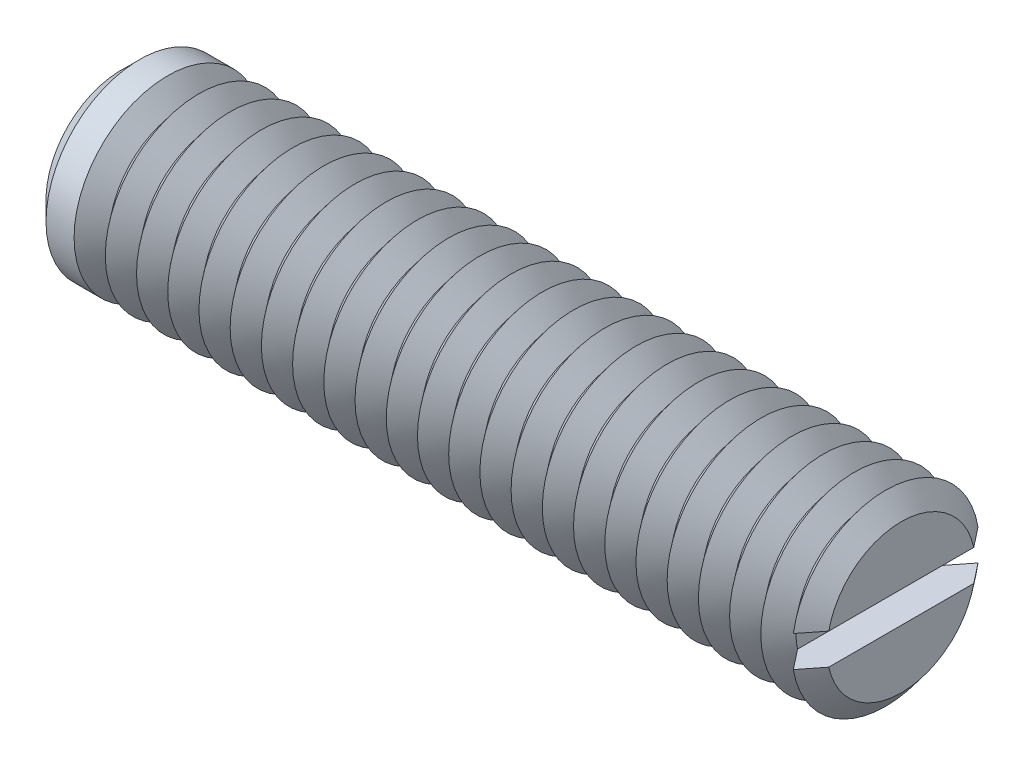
from build123d import *

# Parameters (mm, degrees)
SKETCH1_R       = 3
EXTRUDE1_DEPTH  = 12.5
SKETCH2_W       = 1
SKETCH2_H       = 1
EXTRUDE2_DEPTH  = 4.5
CHAMFER1_SIZE   = 0.6
LPATTERN1_COUNT = 24
LPATTERN1_PITCH = 1


with BuildPart() as part:
    # Sketch1 → Extrude1 (new, symmetric)
    with BuildSketch(Plane(origin=(0, 0, 0), x_dir=(0, 0, -1), z_dir=(1, 0, 0))):
        Circle(SKETCH1_R)
    extrude(amount=EXTRUDE1_DEPTH, both=True)

    # Sketch2 → Extrude2 (cut, symmetric)
    with BuildSketch(Plane.XY):
        with Locations((12, 0)):
            Rectangle(SKETCH2_W, SKETCH2_H)
    extrude(amount=EXTRUDE2_DEPTH, both=True, mode=Mode.SUBTRACT)

    # Chamfer1
    chamfer1_edges = [part.edges().sort_by_distance(p)[0] for p in [
        (-12.5, 0, 3),
    ]]
    chamfer(chamfer1_edges, length=CHAMFER1_SIZE)

    # Sketch3 → Cut-Revolve1 (revolve, cut)
    with BuildSketch(Plane.XY, mode=Mode.PRIVATE) as cut_revolve1_sk:
        Polygon((12, -3), (13, -3), (12.5, -2.3755002), align=None)
    cut_revolve1 = revolve(cut_revolve1_sk.sketch.rotate(Axis((0, 0, 0), (1, 0, 0)), 260.405931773), axis=Axis((0, 0, 0), (1, 0, 0)), mode=Mode.SUBTRACT)

    # LPattern1: Cut-Revolve1 ×24
    with Locations(*[(-i * LPATTERN1_PITCH, 0, 0) for i in range(1, LPATTERN1_COUNT)]):
        add(cut_revolve1, mode=Mode.SUBTRACT)


solid = part.part
